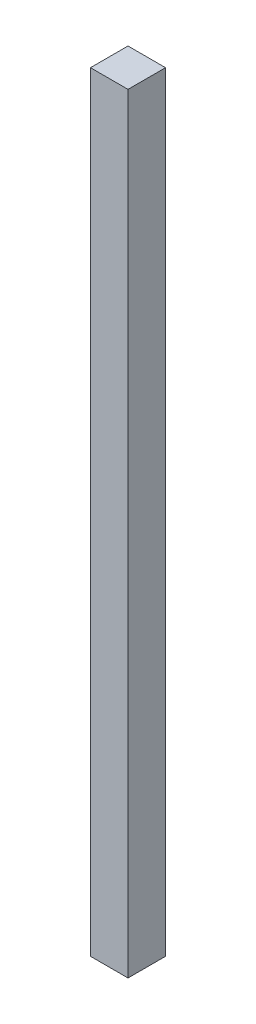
from build123d import *

# Parameters (mm, degrees)
ESQUISSE1_W        = 40
ESQUISSE1_H        = 820
BOSS_EXTRU_1_DEPTH = 40


with BuildPart() as part:
    # Esquisse1 → Boss.-Extru.1 (new body)
    with BuildSketch(Plane.XY):
        with Locations((-20, 410)):
            Rectangle(ESQUISSE1_W, ESQUISSE1_H)
    extrude(amount=-BOSS_EXTRU_1_DEPTH)


solid = part.part
